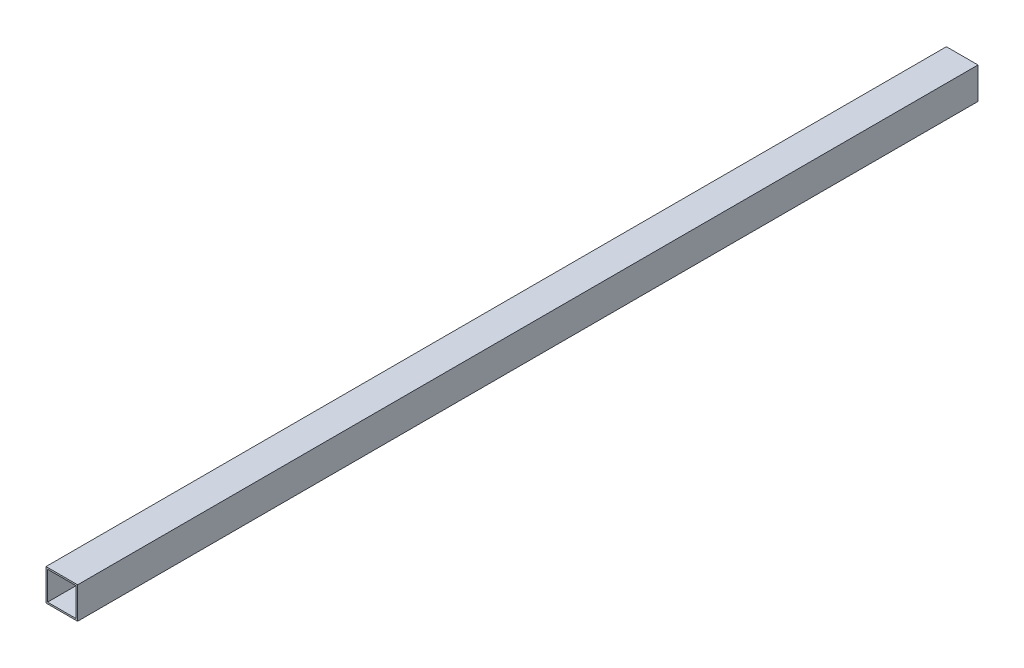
ISO-10303-21;
HEADER;
FILE_DESCRIPTION(('STEP AP214'),'2;1');
FILE_NAME('part.step','',(''),(''),'','','');
FILE_SCHEMA(('AUTOMOTIVE_DESIGN { 1 0 10303 214 1 1 1 1 }'));
ENDSEC;
DATA;
#1=APPLICATION_CONTEXT('core data for automotive mechanical design processes');
#2=APPLICATION_PROTOCOL_DEFINITION('international standard','automotive_design',2000,#1);
#3=PRODUCT_CONTEXT('',#1,'mechanical');
#4=PRODUCT('Part','Part','',(#3));
#5=PRODUCT_RELATED_PRODUCT_CATEGORY('part','',(#4));
#6=PRODUCT_DEFINITION_FORMATION('','',#4);
#7=PRODUCT_DEFINITION_CONTEXT('part definition',#1,'design');
#8=PRODUCT_DEFINITION('design','',#6,#7);
#9=PRODUCT_DEFINITION_SHAPE('','',#8);
#10=(LENGTH_UNIT() NAMED_UNIT(*) SI_UNIT(.MILLI.,.METRE.));
#11=(NAMED_UNIT(*) PLANE_ANGLE_UNIT() SI_UNIT($,.RADIAN.));
#12=(NAMED_UNIT(*) SI_UNIT($,.STERADIAN.) SOLID_ANGLE_UNIT());
#13=UNCERTAINTY_MEASURE_WITH_UNIT(LENGTH_MEASURE(1.E-05),#10,'distance_accuracy_value','');
#14=(GEOMETRIC_REPRESENTATION_CONTEXT(3) GLOBAL_UNCERTAINTY_ASSIGNED_CONTEXT((#13)) GLOBAL_UNIT_ASSIGNED_CONTEXT((#10,
#11,#12)) REPRESENTATION_CONTEXT('',''));
#15=CARTESIAN_POINT('',(0.,0.,0.));
#16=DIRECTION('',(0.,0.,1.));
#17=DIRECTION('',(1.,0.,0.));
#18=AXIS2_PLACEMENT_3D('',#15,#16,#17);
#19=CARTESIAN_POINT('',(0.,0.,2848.));
#20=DIRECTION('',(0.,0.,1.));
#21=DIRECTION('',(1.,0.,0.));
#22=AXIS2_PLACEMENT_3D('',#19,#20,#21);
#23=PLANE('',#22);
#24=DIRECTION('',(0.,-1.,0.));
#25=VECTOR('',#24,1.);
#26=CARTESIAN_POINT('',(-45.,45.,2848.));
#27=LINE('',#26,#25);
#28=CARTESIAN_POINT('',(-45.,45.,2848.));
#29=VERTEX_POINT('',#28);
#30=CARTESIAN_POINT('',(-45.,-45.,2848.));
#31=VERTEX_POINT('',#30);
#32=EDGE_CURVE('E25',#29,#31,#27,.T.);
#33=ORIENTED_EDGE('',*,*,#32,.F.);
#34=DIRECTION('',(-1.,0.,0.));
#35=VECTOR('',#34,1.);
#36=CARTESIAN_POINT('',(45.,45.,2848.));
#37=LINE('',#36,#35);
#38=CARTESIAN_POINT('',(45.,45.,2848.));
#39=VERTEX_POINT('',#38);
#40=EDGE_CURVE('E93',#39,#29,#37,.T.);
#41=ORIENTED_EDGE('',*,*,#40,.F.);
#42=DIRECTION('',(0.,1.,0.));
#43=VECTOR('',#42,1.);
#44=CARTESIAN_POINT('',(45.,-45.,2848.));
#45=LINE('',#44,#43);
#46=CARTESIAN_POINT('',(45.,-45.,2848.));
#47=VERTEX_POINT('',#46);
#48=EDGE_CURVE('E96',#47,#39,#45,.T.);
#49=ORIENTED_EDGE('',*,*,#48,.F.);
#50=DIRECTION('',(1.,0.,0.));
#51=VECTOR('',#50,1.);
#52=CARTESIAN_POINT('',(-45.,-45.,2848.));
#53=LINE('',#52,#51);
#54=EDGE_CURVE('E115',#31,#47,#53,.T.);
#55=ORIENTED_EDGE('',*,*,#54,.F.);
#56=EDGE_LOOP('',(#33,#41,#49,#55));
#57=FACE_BOUND('',#56,.T.);
#58=DIRECTION('',(1.,0.,0.));
#59=VECTOR('',#58,1.);
#60=CARTESIAN_POINT('',(-50.,-50.,2848.));
#61=LINE('',#60,#59);
#62=CARTESIAN_POINT('',(-50.,-50.,2848.));
#63=VERTEX_POINT('',#62);
#64=CARTESIAN_POINT('',(50.,-50.,2848.));
#65=VERTEX_POINT('',#64);
#66=EDGE_CURVE('E208',#63,#65,#61,.T.);
#67=ORIENTED_EDGE('',*,*,#66,.T.);
#68=DIRECTION('',(0.,1.,0.));
#69=VECTOR('',#68,1.);
#70=CARTESIAN_POINT('',(50.,-50.,2848.));
#71=LINE('',#70,#69);
#72=CARTESIAN_POINT('',(50.,50.,2848.));
#73=VERTEX_POINT('',#72);
#74=EDGE_CURVE('E146',#65,#73,#71,.T.);
#75=ORIENTED_EDGE('',*,*,#74,.T.);
#76=DIRECTION('',(-1.,0.,0.));
#77=VECTOR('',#76,1.);
#78=CARTESIAN_POINT('',(50.,50.,2848.));
#79=LINE('',#78,#77);
#80=CARTESIAN_POINT('',(-50.,50.,2848.));
#81=VERTEX_POINT('',#80);
#82=EDGE_CURVE('E151',#73,#81,#79,.T.);
#83=ORIENTED_EDGE('',*,*,#82,.T.);
#84=DIRECTION('',(0.,-1.,0.));
#85=VECTOR('',#84,1.);
#86=CARTESIAN_POINT('',(-50.,50.,2848.));
#87=LINE('',#86,#85);
#88=EDGE_CURVE('E123',#81,#63,#87,.T.);
#89=ORIENTED_EDGE('',*,*,#88,.T.);
#90=EDGE_LOOP('',(#67,#75,#83,#89));
#91=FACE_BOUND('',#90,.T.);
#92=ADVANCED_FACE('F16',(#57,#91),#23,.T.);
#93=CARTESIAN_POINT('',(0.,0.,0.));
#94=DIRECTION('',(0.,0.,1.));
#95=DIRECTION('',(1.,0.,0.));
#96=AXIS2_PLACEMENT_3D('',#93,#94,#95);
#97=PLANE('',#96);
#98=DIRECTION('',(1.,0.,0.));
#99=VECTOR('',#98,1.);
#100=CARTESIAN_POINT('',(-45.,-45.,0.));
#101=LINE('',#100,#99);
#102=CARTESIAN_POINT('',(-45.,-45.,0.));
#103=VERTEX_POINT('',#102);
#104=CARTESIAN_POINT('',(45.,-45.,0.));
#105=VERTEX_POINT('',#104);
#106=EDGE_CURVE('E88',#103,#105,#101,.T.);
#107=ORIENTED_EDGE('',*,*,#106,.T.);
#108=DIRECTION('',(0.,1.,0.));
#109=VECTOR('',#108,1.);
#110=CARTESIAN_POINT('',(45.,-45.,0.));
#111=LINE('',#110,#109);
#112=CARTESIAN_POINT('',(45.,45.,0.));
#113=VERTEX_POINT('',#112);
#114=EDGE_CURVE('E84',#105,#113,#111,.T.);
#115=ORIENTED_EDGE('',*,*,#114,.T.);
#116=DIRECTION('',(-1.,0.,0.));
#117=VECTOR('',#116,1.);
#118=CARTESIAN_POINT('',(45.,45.,0.));
#119=LINE('',#118,#117);
#120=CARTESIAN_POINT('',(-45.,45.,0.));
#121=VERTEX_POINT('',#120);
#122=EDGE_CURVE('E72',#113,#121,#119,.T.);
#123=ORIENTED_EDGE('',*,*,#122,.T.);
#124=DIRECTION('',(0.,-1.,0.));
#125=VECTOR('',#124,1.);
#126=CARTESIAN_POINT('',(-45.,45.,0.));
#127=LINE('',#126,#125);
#128=EDGE_CURVE('E10',#121,#103,#127,.T.);
#129=ORIENTED_EDGE('',*,*,#128,.T.);
#130=EDGE_LOOP('',(#107,#115,#123,#129));
#131=FACE_BOUND('',#130,.T.);
#132=DIRECTION('',(0.,-1.,0.));
#133=VECTOR('',#132,1.);
#134=CARTESIAN_POINT('',(-50.,50.,0.));
#135=LINE('',#134,#133);
#136=CARTESIAN_POINT('',(-50.,50.,0.));
#137=VERTEX_POINT('',#136);
#138=CARTESIAN_POINT('',(-50.,-50.,0.));
#139=VERTEX_POINT('',#138);
#140=EDGE_CURVE('E129',#137,#139,#135,.T.);
#141=ORIENTED_EDGE('',*,*,#140,.F.);
#142=DIRECTION('',(-1.,0.,0.));
#143=VECTOR('',#142,1.);
#144=CARTESIAN_POINT('',(50.,50.,0.));
#145=LINE('',#144,#143);
#146=CARTESIAN_POINT('',(50.,50.,0.));
#147=VERTEX_POINT('',#146);
#148=EDGE_CURVE('E159',#147,#137,#145,.T.);
#149=ORIENTED_EDGE('',*,*,#148,.F.);
#150=DIRECTION('',(0.,1.,0.));
#151=VECTOR('',#150,1.);
#152=CARTESIAN_POINT('',(50.,-50.,0.));
#153=LINE('',#152,#151);
#154=CARTESIAN_POINT('',(50.,-50.,0.));
#155=VERTEX_POINT('',#154);
#156=EDGE_CURVE('E147',#155,#147,#153,.T.);
#157=ORIENTED_EDGE('',*,*,#156,.F.);
#158=DIRECTION('',(1.,0.,0.));
#159=VECTOR('',#158,1.);
#160=CARTESIAN_POINT('',(-50.,-50.,0.));
#161=LINE('',#160,#159);
#162=EDGE_CURVE('E206',#139,#155,#161,.T.);
#163=ORIENTED_EDGE('',*,*,#162,.F.);
#164=EDGE_LOOP('',(#141,#149,#157,#163));
#165=FACE_BOUND('',#164,.T.);
#166=ADVANCED_FACE('F85',(#131,#165),#97,.F.);
#167=CARTESIAN_POINT('',(-45.,45.,0.));
#168=DIRECTION('',(1.,0.,0.));
#169=DIRECTION('',(0.,1.,0.));
#170=AXIS2_PLACEMENT_3D('',#167,#168,#169);
#171=PLANE('',#170);
#172=DIRECTION('',(0.,0.,1.));
#173=VECTOR('',#172,1.);
#174=CARTESIAN_POINT('',(-45.,45.,0.));
#175=LINE('',#174,#173);
#176=EDGE_CURVE('E79',#121,#29,#175,.T.);
#177=ORIENTED_EDGE('',*,*,#176,.T.);
#178=ORIENTED_EDGE('',*,*,#32,.T.);
#179=DIRECTION('',(0.,0.,1.));
#180=VECTOR('',#179,1.);
#181=CARTESIAN_POINT('',(-45.,-45.,0.));
#182=LINE('',#181,#180);
#183=EDGE_CURVE('E112',#103,#31,#182,.T.);
#184=ORIENTED_EDGE('',*,*,#183,.F.);
#185=ORIENTED_EDGE('',*,*,#128,.F.);
#186=EDGE_LOOP('',(#177,#178,#184,#185));
#187=FACE_BOUND('',#186,.T.);
#188=ADVANCED_FACE('F110',(#187),#171,.T.);
#189=CARTESIAN_POINT('',(45.,45.,0.));
#190=DIRECTION('',(0.,-1.,0.));
#191=DIRECTION('',(0.,0.,-1.));
#192=AXIS2_PLACEMENT_3D('',#189,#190,#191);
#193=PLANE('',#192);
#194=DIRECTION('',(0.,0.,1.));
#195=VECTOR('',#194,1.);
#196=CARTESIAN_POINT('',(45.,45.,0.));
#197=LINE('',#196,#195);
#198=EDGE_CURVE('E77',#113,#39,#197,.T.);
#199=ORIENTED_EDGE('',*,*,#198,.T.);
#200=ORIENTED_EDGE('',*,*,#40,.T.);
#201=ORIENTED_EDGE('',*,*,#176,.F.);
#202=ORIENTED_EDGE('',*,*,#122,.F.);
#203=EDGE_LOOP('',(#199,#200,#201,#202));
#204=FACE_BOUND('',#203,.T.);
#205=ADVANCED_FACE('F74',(#204),#193,.T.);
#206=CARTESIAN_POINT('',(45.,-45.,0.));
#207=DIRECTION('',(-1.,0.,0.));
#208=DIRECTION('',(0.,0.,1.));
#209=AXIS2_PLACEMENT_3D('',#206,#207,#208);
#210=PLANE('',#209);
#211=DIRECTION('',(0.,0.,1.));
#212=VECTOR('',#211,1.);
#213=CARTESIAN_POINT('',(45.,-45.,0.));
#214=LINE('',#213,#212);
#215=EDGE_CURVE('E119',#105,#47,#214,.T.);
#216=ORIENTED_EDGE('',*,*,#215,.T.);
#217=ORIENTED_EDGE('',*,*,#48,.T.);
#218=ORIENTED_EDGE('',*,*,#198,.F.);
#219=ORIENTED_EDGE('',*,*,#114,.F.);
#220=EDGE_LOOP('',(#216,#217,#218,#219));
#221=FACE_BOUND('',#220,.T.);
#222=ADVANCED_FACE('F95',(#221),#210,.T.);
#223=CARTESIAN_POINT('',(-45.,-45.,0.));
#224=DIRECTION('',(0.,1.,0.));
#225=DIRECTION('',(1.,0.,0.));
#226=AXIS2_PLACEMENT_3D('',#223,#224,#225);
#227=PLANE('',#226);
#228=ORIENTED_EDGE('',*,*,#183,.T.);
#229=ORIENTED_EDGE('',*,*,#54,.T.);
#230=ORIENTED_EDGE('',*,*,#215,.F.);
#231=ORIENTED_EDGE('',*,*,#106,.F.);
#232=EDGE_LOOP('',(#228,#229,#230,#231));
#233=FACE_BOUND('',#232,.T.);
#234=ADVANCED_FACE('F121',(#233),#227,.T.);
#235=CARTESIAN_POINT('',(-50.,50.,0.));
#236=DIRECTION('',(1.,0.,0.));
#237=DIRECTION('',(0.,1.,0.));
#238=AXIS2_PLACEMENT_3D('',#235,#236,#237);
#239=PLANE('',#238);
#240=ORIENTED_EDGE('',*,*,#140,.T.);
#241=DIRECTION('',(0.,0.,1.));
#242=VECTOR('',#241,1.);
#243=CARTESIAN_POINT('',(-50.,-50.,0.));
#244=LINE('',#243,#242);
#245=EDGE_CURVE('E141',#139,#63,#244,.T.);
#246=ORIENTED_EDGE('',*,*,#245,.T.);
#247=ORIENTED_EDGE('',*,*,#88,.F.);
#248=DIRECTION('',(0.,0.,1.));
#249=VECTOR('',#248,1.);
#250=CARTESIAN_POINT('',(-50.,50.,0.));
#251=LINE('',#250,#249);
#252=EDGE_CURVE('E155',#137,#81,#251,.T.);
#253=ORIENTED_EDGE('',*,*,#252,.F.);
#254=EDGE_LOOP('',(#240,#246,#247,#253));
#255=FACE_BOUND('',#254,.T.);
#256=ADVANCED_FACE('F200',(#255),#239,.F.);
#257=CARTESIAN_POINT('',(50.,50.,0.));
#258=DIRECTION('',(0.,-1.,0.));
#259=DIRECTION('',(0.,0.,-1.));
#260=AXIS2_PLACEMENT_3D('',#257,#258,#259);
#261=PLANE('',#260);
#262=ORIENTED_EDGE('',*,*,#148,.T.);
#263=ORIENTED_EDGE('',*,*,#252,.T.);
#264=ORIENTED_EDGE('',*,*,#82,.F.);
#265=DIRECTION('',(0.,0.,1.));
#266=VECTOR('',#265,1.);
#267=CARTESIAN_POINT('',(50.,50.,0.));
#268=LINE('',#267,#266);
#269=EDGE_CURVE('E143',#147,#73,#268,.T.);
#270=ORIENTED_EDGE('',*,*,#269,.F.);
#271=EDGE_LOOP('',(#262,#263,#264,#270));
#272=FACE_BOUND('',#271,.T.);
#273=ADVANCED_FACE('F169',(#272),#261,.F.);
#274=CARTESIAN_POINT('',(50.,-50.,0.));
#275=DIRECTION('',(-1.,0.,0.));
#276=DIRECTION('',(0.,0.,1.));
#277=AXIS2_PLACEMENT_3D('',#274,#275,#276);
#278=PLANE('',#277);
#279=ORIENTED_EDGE('',*,*,#156,.T.);
#280=ORIENTED_EDGE('',*,*,#269,.T.);
#281=ORIENTED_EDGE('',*,*,#74,.F.);
#282=DIRECTION('',(0.,0.,1.));
#283=VECTOR('',#282,1.);
#284=CARTESIAN_POINT('',(50.,-50.,0.));
#285=LINE('',#284,#283);
#286=EDGE_CURVE('E210',#155,#65,#285,.T.);
#287=ORIENTED_EDGE('',*,*,#286,.F.);
#288=EDGE_LOOP('',(#279,#280,#281,#287));
#289=FACE_BOUND('',#288,.T.);
#290=ADVANCED_FACE('F218',(#289),#278,.F.);
#291=CARTESIAN_POINT('',(-50.,-50.,0.));
#292=DIRECTION('',(0.,1.,0.));
#293=DIRECTION('',(1.,0.,0.));
#294=AXIS2_PLACEMENT_3D('',#291,#292,#293);
#295=PLANE('',#294);
#296=ORIENTED_EDGE('',*,*,#162,.T.);
#297=ORIENTED_EDGE('',*,*,#286,.T.);
#298=ORIENTED_EDGE('',*,*,#66,.F.);
#299=ORIENTED_EDGE('',*,*,#245,.F.);
#300=EDGE_LOOP('',(#296,#297,#298,#299));
#301=FACE_BOUND('',#300,.T.);
#302=ADVANCED_FACE('F204',(#301),#295,.F.);
#303=CLOSED_SHELL('',(#92,#166,#188,#205,#222,#234,#256,#273,#290,#302));
#304=MANIFOLD_SOLID_BREP('B1',#303);
#305=ADVANCED_BREP_SHAPE_REPRESENTATION('',(#18,#304),#14);
#306=SHAPE_DEFINITION_REPRESENTATION(#9,#305);
ENDSEC;
END-ISO-10303-21;
